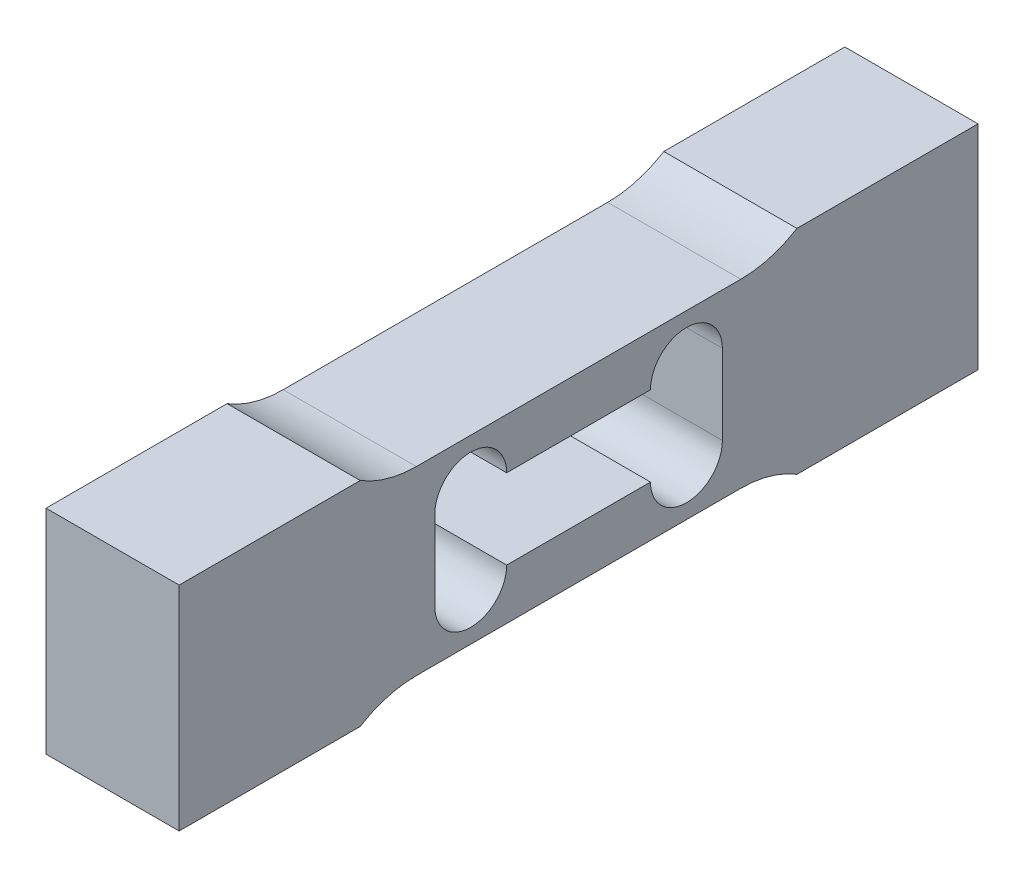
ISO-10303-21;
HEADER;
FILE_DESCRIPTION(('STEP AP214'),'2;1');
FILE_NAME('part.step','',(''),(''),'','','');
FILE_SCHEMA(('AUTOMOTIVE_DESIGN { 1 0 10303 214 1 1 1 1 }'));
ENDSEC;
DATA;
#1=APPLICATION_CONTEXT('core data for automotive mechanical design processes');
#2=APPLICATION_PROTOCOL_DEFINITION('international standard','automotive_design',2000,#1);
#3=PRODUCT_CONTEXT('',#1,'mechanical');
#4=PRODUCT('Part','Part','',(#3));
#5=PRODUCT_RELATED_PRODUCT_CATEGORY('part','',(#4));
#6=PRODUCT_DEFINITION_FORMATION('','',#4);
#7=PRODUCT_DEFINITION_CONTEXT('part definition',#1,'design');
#8=PRODUCT_DEFINITION('design','',#6,#7);
#9=PRODUCT_DEFINITION_SHAPE('','',#8);
#10=(LENGTH_UNIT() NAMED_UNIT(*) SI_UNIT(.MILLI.,.METRE.));
#11=(NAMED_UNIT(*) PLANE_ANGLE_UNIT() SI_UNIT($,.RADIAN.));
#12=(NAMED_UNIT(*) SI_UNIT($,.STERADIAN.) SOLID_ANGLE_UNIT());
#13=UNCERTAINTY_MEASURE_WITH_UNIT(LENGTH_MEASURE(1.E-05),#10,'distance_accuracy_value','');
#14=(GEOMETRIC_REPRESENTATION_CONTEXT(3) GLOBAL_UNCERTAINTY_ASSIGNED_CONTEXT((#13)) GLOBAL_UNIT_ASSIGNED_CONTEXT((#10,
#11,#12)) REPRESENTATION_CONTEXT('',''));
#15=CARTESIAN_POINT('',(0.,0.,0.));
#16=DIRECTION('',(0.,0.,1.));
#17=DIRECTION('',(1.,0.,0.));
#18=AXIS2_PLACEMENT_3D('',#15,#16,#17);
#19=CARTESIAN_POINT('',(12.5,-20.,75.));
#20=DIRECTION('',(0.,1.,0.));
#21=DIRECTION('',(0.,0.,1.));
#22=AXIS2_PLACEMENT_3D('',#19,#20,#21);
#23=PLANE('',#22);
#24=DIRECTION('',(0.,0.,-1.));
#25=VECTOR('',#24,1.);
#26=CARTESIAN_POINT('',(-12.5,-20.,75.));
#27=LINE('',#26,#25);
#28=CARTESIAN_POINT('',(-12.5,-20.,75.));
#29=VERTEX_POINT('',#28);
#30=CARTESIAN_POINT('',(-12.5,-20.,41.));
#31=VERTEX_POINT('',#30);
#32=EDGE_CURVE('E188',#29,#31,#27,.T.);
#33=ORIENTED_EDGE('',*,*,#32,.T.);
#34=DIRECTION('',(1.,0.,0.));
#35=VECTOR('',#34,1.);
#36=CARTESIAN_POINT('',(12.5,-20.,41.));
#37=LINE('',#36,#35);
#38=CARTESIAN_POINT('',(12.5,-20.,41.));
#39=VERTEX_POINT('',#38);
#40=EDGE_CURVE('E175',#31,#39,#37,.T.);
#41=ORIENTED_EDGE('',*,*,#40,.T.);
#42=DIRECTION('',(0.,0.,-1.));
#43=VECTOR('',#42,1.);
#44=CARTESIAN_POINT('',(12.5,-20.,75.));
#45=LINE('',#44,#43);
#46=CARTESIAN_POINT('',(12.5,-20.,75.));
#47=VERTEX_POINT('',#46);
#48=EDGE_CURVE('E186',#47,#39,#45,.T.);
#49=ORIENTED_EDGE('',*,*,#48,.F.);
#50=DIRECTION('',(-1.,0.,0.));
#51=VECTOR('',#50,1.);
#52=CARTESIAN_POINT('',(12.5,-20.,75.));
#53=LINE('',#52,#51);
#54=EDGE_CURVE('E229',#47,#29,#53,.T.);
#55=ORIENTED_EDGE('',*,*,#54,.T.);
#56=EDGE_LOOP('',(#33,#41,#49,#55));
#57=FACE_BOUND('',#56,.T.);
#58=ADVANCED_FACE('F34',(#57),#23,.F.);
#59=CARTESIAN_POINT('',(12.5,20.,75.));
#60=DIRECTION('',(0.,-1.,0.));
#61=DIRECTION('',(0.,0.,-1.));
#62=AXIS2_PLACEMENT_3D('',#59,#60,#61);
#63=PLANE('',#62);
#64=DIRECTION('',(0.,0.,1.));
#65=VECTOR('',#64,1.);
#66=CARTESIAN_POINT('',(12.5,20.,75.));
#67=LINE('',#66,#65);
#68=CARTESIAN_POINT('',(12.5,20.,41.));
#69=VERTEX_POINT('',#68);
#70=CARTESIAN_POINT('',(12.5,20.,75.));
#71=VERTEX_POINT('',#70);
#72=EDGE_CURVE('E200',#69,#71,#67,.T.);
#73=ORIENTED_EDGE('',*,*,#72,.F.);
#74=DIRECTION('',(-1.,0.,0.));
#75=VECTOR('',#74,1.);
#76=CARTESIAN_POINT('',(12.5,20.,41.));
#77=LINE('',#76,#75);
#78=CARTESIAN_POINT('',(-12.5,20.,41.));
#79=VERTEX_POINT('',#78);
#80=EDGE_CURVE('E234',#69,#79,#77,.T.);
#81=ORIENTED_EDGE('',*,*,#80,.T.);
#82=DIRECTION('',(0.,0.,1.));
#83=VECTOR('',#82,1.);
#84=CARTESIAN_POINT('',(-12.5,20.,75.));
#85=LINE('',#84,#83);
#86=CARTESIAN_POINT('',(-12.5,20.,75.));
#87=VERTEX_POINT('',#86);
#88=EDGE_CURVE('E217',#79,#87,#85,.T.);
#89=ORIENTED_EDGE('',*,*,#88,.T.);
#90=DIRECTION('',(-1.,0.,0.));
#91=VECTOR('',#90,1.);
#92=CARTESIAN_POINT('',(12.5,20.,75.));
#93=LINE('',#92,#91);
#94=EDGE_CURVE('E208',#71,#87,#93,.T.);
#95=ORIENTED_EDGE('',*,*,#94,.F.);
#96=EDGE_LOOP('',(#73,#81,#89,#95));
#97=FACE_BOUND('',#96,.T.);
#98=ADVANCED_FACE('F260',(#97),#63,.F.);
#99=CARTESIAN_POINT('',(12.5,-20.,75.));
#100=DIRECTION('',(1.,0.,0.));
#101=DIRECTION('',(0.,0.,-1.));
#102=AXIS2_PLACEMENT_3D('',#99,#100,#101);
#103=PLANE('',#102);
#104=ORIENTED_EDGE('',*,*,#48,.T.);
#105=CARTESIAN_POINT('',(12.5,-37.,30.4643462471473));
#106=DIRECTION('',(1.,0.,0.));
#107=DIRECTION('',(0.,0.,-1.));
#108=AXIS2_PLACEMENT_3D('',#105,#106,#107);
#109=CIRCLE('',#108,20.);
#110=CARTESIAN_POINT('',(12.5,-17.,30.4643462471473));
#111=VERTEX_POINT('',#110);
#112=EDGE_CURVE('E171',#39,#111,#109,.F.);
#113=ORIENTED_EDGE('',*,*,#112,.T.);
#114=DIRECTION('',(0.,0.,1.));
#115=VECTOR('',#114,1.);
#116=CARTESIAN_POINT('',(12.5,-17.,41.));
#117=LINE('',#116,#115);
#118=CARTESIAN_POINT('',(12.5,-17.,-30.4643462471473));
#119=VERTEX_POINT('',#118);
#120=EDGE_CURVE('E272',#119,#111,#117,.T.);
#121=ORIENTED_EDGE('',*,*,#120,.F.);
#122=CARTESIAN_POINT('',(12.5,-37.,-30.4643462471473));
#123=DIRECTION('',(1.,0.,0.));
#124=DIRECTION('',(0.,0.,-1.));
#125=AXIS2_PLACEMENT_3D('',#122,#123,#124);
#126=CIRCLE('',#125,20.);
#127=CARTESIAN_POINT('',(12.5,-20.,-41.));
#128=VERTEX_POINT('',#127);
#129=EDGE_CURVE('E245',#119,#128,#126,.F.);
#130=ORIENTED_EDGE('',*,*,#129,.T.);
#131=CARTESIAN_POINT('',(12.5,-20.,-75.));
#132=VERTEX_POINT('',#131);
#133=EDGE_CURVE('E198',#128,#132,#45,.T.);
#134=ORIENTED_EDGE('',*,*,#133,.T.);
#135=DIRECTION('',(0.,1.,0.));
#136=VECTOR('',#135,1.);
#137=CARTESIAN_POINT('',(12.5,20.,-75.));
#138=LINE('',#137,#136);
#139=CARTESIAN_POINT('',(12.5,20.,-75.));
#140=VERTEX_POINT('',#139);
#141=EDGE_CURVE('E197',#132,#140,#138,.T.);
#142=ORIENTED_EDGE('',*,*,#141,.T.);
#143=CARTESIAN_POINT('',(12.5,20.,-41.));
#144=VERTEX_POINT('',#143);
#145=EDGE_CURVE('E205',#140,#144,#67,.T.);
#146=ORIENTED_EDGE('',*,*,#145,.T.);
#147=CARTESIAN_POINT('',(12.5,37.,-30.4643462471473));
#148=DIRECTION('',(1.,0.,0.));
#149=DIRECTION('',(0.,0.,-1.));
#150=AXIS2_PLACEMENT_3D('',#147,#148,#149);
#151=CIRCLE('',#150,20.);
#152=CARTESIAN_POINT('',(12.5,17.,-30.4643462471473));
#153=VERTEX_POINT('',#152);
#154=EDGE_CURVE('E249',#144,#153,#151,.F.);
#155=ORIENTED_EDGE('',*,*,#154,.T.);
#156=DIRECTION('',(0.,0.,-1.));
#157=VECTOR('',#156,1.);
#158=CARTESIAN_POINT('',(12.5,17.,41.));
#159=LINE('',#158,#157);
#160=CARTESIAN_POINT('',(12.5,17.,30.4643462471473));
#161=VERTEX_POINT('',#160);
#162=EDGE_CURVE('E255',#161,#153,#159,.T.);
#163=ORIENTED_EDGE('',*,*,#162,.F.);
#164=CARTESIAN_POINT('',(12.5,37.,30.4643462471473));
#165=DIRECTION('',(1.,0.,0.));
#166=DIRECTION('',(0.,0.,-1.));
#167=AXIS2_PLACEMENT_3D('',#164,#165,#166);
#168=CIRCLE('',#167,20.);
#169=EDGE_CURVE('E42',#161,#69,#168,.F.);
#170=ORIENTED_EDGE('',*,*,#169,.T.);
#171=ORIENTED_EDGE('',*,*,#72,.T.);
#172=DIRECTION('',(0.,-1.,0.));
#173=VECTOR('',#172,1.);
#174=CARTESIAN_POINT('',(12.5,20.,75.));
#175=LINE('',#174,#173);
#176=EDGE_CURVE('E195',#71,#47,#175,.T.);
#177=ORIENTED_EDGE('',*,*,#176,.T.);
#178=EDGE_LOOP('',(#104,#113,#121,#130,#134,#142,#146,#155,#163,#170,#171,#177));
#179=FACE_BOUND('',#178,.T.);
#180=DIRECTION('',(0.,-1.,0.));
#181=VECTOR('',#180,1.);
#182=CARTESIAN_POINT('',(12.5,7.49999999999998,27.));
#183=LINE('',#182,#181);
#184=CARTESIAN_POINT('',(12.5,7.49999999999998,27.));
#185=VERTEX_POINT('',#184);
#186=CARTESIAN_POINT('',(12.5,-7.50000000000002,27.));
#187=VERTEX_POINT('',#186);
#188=EDGE_CURVE('E277',#185,#187,#183,.T.);
#189=ORIENTED_EDGE('',*,*,#188,.F.);
#190=CARTESIAN_POINT('',(12.5,7.49999999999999,20.25));
#191=DIRECTION('',(1.,0.,0.));
#192=DIRECTION('',(0.,0.,1.));
#193=AXIS2_PLACEMENT_3D('',#190,#191,#192);
#194=CIRCLE('',#193,6.75);
#195=CARTESIAN_POINT('',(12.5,7.5,13.5));
#196=VERTEX_POINT('',#195);
#197=EDGE_CURVE('E275',#196,#185,#194,.T.);
#198=ORIENTED_EDGE('',*,*,#197,.F.);
#199=DIRECTION('',(0.,0.,1.));
#200=VECTOR('',#199,1.);
#201=CARTESIAN_POINT('',(12.5,7.5,13.5));
#202=LINE('',#201,#200);
#203=CARTESIAN_POINT('',(12.5,7.50000000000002,-13.5));
#204=VERTEX_POINT('',#203);
#205=EDGE_CURVE('E291',#204,#196,#202,.T.);
#206=ORIENTED_EDGE('',*,*,#205,.F.);
#207=CARTESIAN_POINT('',(12.5,7.50000000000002,-20.25));
#208=DIRECTION('',(1.,0.,0.));
#209=DIRECTION('',(0.,0.,1.));
#210=AXIS2_PLACEMENT_3D('',#207,#208,#209);
#211=CIRCLE('',#210,6.75);
#212=CARTESIAN_POINT('',(12.5,7.50000000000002,-27.));
#213=VERTEX_POINT('',#212);
#214=EDGE_CURVE('E288',#213,#204,#211,.T.);
#215=ORIENTED_EDGE('',*,*,#214,.F.);
#216=DIRECTION('',(0.,1.,0.));
#217=VECTOR('',#216,1.);
#218=CARTESIAN_POINT('',(12.5,7.50000000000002,-27.));
#219=LINE('',#218,#217);
#220=CARTESIAN_POINT('',(12.5,-7.49999999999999,-27.));
#221=VERTEX_POINT('',#220);
#222=EDGE_CURVE('E286',#221,#213,#219,.T.);
#223=ORIENTED_EDGE('',*,*,#222,.F.);
#224=CARTESIAN_POINT('',(12.5,-7.5,-20.25));
#225=DIRECTION('',(1.,0.,0.));
#226=DIRECTION('',(0.,0.,1.));
#227=AXIS2_PLACEMENT_3D('',#224,#225,#226);
#228=CIRCLE('',#227,6.75);
#229=CARTESIAN_POINT('',(12.5,-7.5,-13.5));
#230=VERTEX_POINT('',#229);
#231=EDGE_CURVE('E284',#230,#221,#228,.T.);
#232=ORIENTED_EDGE('',*,*,#231,.F.);
#233=DIRECTION('',(0.,0.,-1.));
#234=VECTOR('',#233,1.);
#235=CARTESIAN_POINT('',(12.5,-7.5,13.5));
#236=LINE('',#235,#234);
#237=CARTESIAN_POINT('',(12.5,-7.5,13.5));
#238=VERTEX_POINT('',#237);
#239=EDGE_CURVE('E282',#238,#230,#236,.T.);
#240=ORIENTED_EDGE('',*,*,#239,.F.);
#241=CARTESIAN_POINT('',(12.5,-7.50000000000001,20.25));
#242=DIRECTION('',(1.,0.,0.));
#243=DIRECTION('',(0.,0.,-1.));
#244=AXIS2_PLACEMENT_3D('',#241,#242,#243);
#245=CIRCLE('',#244,6.75);
#246=EDGE_CURVE('E280',#187,#238,#245,.T.);
#247=ORIENTED_EDGE('',*,*,#246,.F.);
#248=EDGE_LOOP('',(#189,#198,#206,#215,#223,#232,#240,#247));
#249=FACE_BOUND('',#248,.T.);
#250=ADVANCED_FACE('F192',(#179,#249),#103,.T.);
#251=CARTESIAN_POINT('',(-12.5,-20.,75.));
#252=DIRECTION('',(1.,0.,0.));
#253=DIRECTION('',(0.,0.,-1.));
#254=AXIS2_PLACEMENT_3D('',#251,#252,#253);
#255=PLANE('',#254);
#256=CARTESIAN_POINT('',(-12.5,-20.,-41.));
#257=VERTEX_POINT('',#256);
#258=CARTESIAN_POINT('',(-12.5,-20.,-75.));
#259=VERTEX_POINT('',#258);
#260=EDGE_CURVE('E212',#257,#259,#27,.T.);
#261=ORIENTED_EDGE('',*,*,#260,.F.);
#262=CARTESIAN_POINT('',(-12.5,-37.,-30.4643462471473));
#263=DIRECTION('',(1.,0.,0.));
#264=DIRECTION('',(0.,0.,-1.));
#265=AXIS2_PLACEMENT_3D('',#262,#263,#264);
#266=CIRCLE('',#265,20.);
#267=CARTESIAN_POINT('',(-12.5,-17.,-30.4643462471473));
#268=VERTEX_POINT('',#267);
#269=EDGE_CURVE('E247',#257,#268,#266,.T.);
#270=ORIENTED_EDGE('',*,*,#269,.T.);
#271=DIRECTION('',(0.,0.,1.));
#272=VECTOR('',#271,1.);
#273=CARTESIAN_POINT('',(-12.5,-17.,41.));
#274=LINE('',#273,#272);
#275=CARTESIAN_POINT('',(-12.5,-17.,30.4643462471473));
#276=VERTEX_POINT('',#275);
#277=EDGE_CURVE('E269',#268,#276,#274,.T.);
#278=ORIENTED_EDGE('',*,*,#277,.T.);
#279=CARTESIAN_POINT('',(-12.5,-37.,30.4643462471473));
#280=DIRECTION('',(1.,0.,0.));
#281=DIRECTION('',(0.,0.,-1.));
#282=AXIS2_PLACEMENT_3D('',#279,#280,#281);
#283=CIRCLE('',#282,20.);
#284=EDGE_CURVE('E181',#276,#31,#283,.T.);
#285=ORIENTED_EDGE('',*,*,#284,.T.);
#286=ORIENTED_EDGE('',*,*,#32,.F.);
#287=DIRECTION('',(0.,-1.,0.));
#288=VECTOR('',#287,1.);
#289=CARTESIAN_POINT('',(-12.5,20.,75.));
#290=LINE('',#289,#288);
#291=EDGE_CURVE('E209',#87,#29,#290,.T.);
#292=ORIENTED_EDGE('',*,*,#291,.F.);
#293=ORIENTED_EDGE('',*,*,#88,.F.);
#294=CARTESIAN_POINT('',(-12.5,37.,30.4643462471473));
#295=DIRECTION('',(1.,0.,0.));
#296=DIRECTION('',(0.,0.,-1.));
#297=AXIS2_PLACEMENT_3D('',#294,#295,#296);
#298=CIRCLE('',#297,20.);
#299=CARTESIAN_POINT('',(-12.5,17.,30.4643462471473));
#300=VERTEX_POINT('',#299);
#301=EDGE_CURVE('E11',#79,#300,#298,.T.);
#302=ORIENTED_EDGE('',*,*,#301,.T.);
#303=DIRECTION('',(0.,0.,-1.));
#304=VECTOR('',#303,1.);
#305=CARTESIAN_POINT('',(-12.5,17.,41.));
#306=LINE('',#305,#304);
#307=CARTESIAN_POINT('',(-12.5,17.,-30.4643462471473));
#308=VERTEX_POINT('',#307);
#309=EDGE_CURVE('E262',#300,#308,#306,.T.);
#310=ORIENTED_EDGE('',*,*,#309,.T.);
#311=CARTESIAN_POINT('',(-12.5,37.,-30.4643462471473));
#312=DIRECTION('',(1.,0.,0.));
#313=DIRECTION('',(0.,0.,-1.));
#314=AXIS2_PLACEMENT_3D('',#311,#312,#313);
#315=CIRCLE('',#314,20.);
#316=CARTESIAN_POINT('',(-12.5,20.,-41.));
#317=VERTEX_POINT('',#316);
#318=EDGE_CURVE('E251',#308,#317,#315,.T.);
#319=ORIENTED_EDGE('',*,*,#318,.T.);
#320=CARTESIAN_POINT('',(-12.5,20.,-75.));
#321=VERTEX_POINT('',#320);
#322=EDGE_CURVE('E218',#321,#317,#85,.T.);
#323=ORIENTED_EDGE('',*,*,#322,.F.);
#324=DIRECTION('',(0.,1.,0.));
#325=VECTOR('',#324,1.);
#326=CARTESIAN_POINT('',(-12.5,20.,-75.));
#327=LINE('',#326,#325);
#328=EDGE_CURVE('E215',#259,#321,#327,.T.);
#329=ORIENTED_EDGE('',*,*,#328,.F.);
#330=EDGE_LOOP('',(#261,#270,#278,#285,#286,#292,#293,#302,#310,#319,#323,#329));
#331=FACE_BOUND('',#330,.T.);
#332=CARTESIAN_POINT('',(-12.5,7.49999999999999,20.25));
#333=DIRECTION('',(1.,0.,0.));
#334=DIRECTION('',(0.,0.,1.));
#335=AXIS2_PLACEMENT_3D('',#332,#333,#334);
#336=CIRCLE('',#335,6.75);
#337=CARTESIAN_POINT('',(-12.5,7.5,13.5));
#338=VERTEX_POINT('',#337);
#339=CARTESIAN_POINT('',(-12.5,7.49999999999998,27.));
#340=VERTEX_POINT('',#339);
#341=EDGE_CURVE('E264',#338,#340,#336,.T.);
#342=ORIENTED_EDGE('',*,*,#341,.T.);
#343=DIRECTION('',(0.,-1.,0.));
#344=VECTOR('',#343,1.);
#345=CARTESIAN_POINT('',(-12.5,7.49999999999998,27.));
#346=LINE('',#345,#344);
#347=CARTESIAN_POINT('',(-12.5,-7.50000000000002,27.));
#348=VERTEX_POINT('',#347);
#349=EDGE_CURVE('E267',#340,#348,#346,.T.);
#350=ORIENTED_EDGE('',*,*,#349,.T.);
#351=CARTESIAN_POINT('',(-12.5,-7.50000000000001,20.25));
#352=DIRECTION('',(1.,0.,0.));
#353=DIRECTION('',(0.,0.,-1.));
#354=AXIS2_PLACEMENT_3D('',#351,#352,#353);
#355=CIRCLE('',#354,6.75);
#356=CARTESIAN_POINT('',(-12.5,-7.5,13.5));
#357=VERTEX_POINT('',#356);
#358=EDGE_CURVE('E296',#348,#357,#355,.T.);
#359=ORIENTED_EDGE('',*,*,#358,.T.);
#360=DIRECTION('',(0.,0.,-1.));
#361=VECTOR('',#360,1.);
#362=CARTESIAN_POINT('',(-12.5,-7.5,13.5));
#363=LINE('',#362,#361);
#364=CARTESIAN_POINT('',(-12.5,-7.5,-13.5));
#365=VERTEX_POINT('',#364);
#366=EDGE_CURVE('E299',#357,#365,#363,.T.);
#367=ORIENTED_EDGE('',*,*,#366,.T.);
#368=CARTESIAN_POINT('',(-12.5,-7.5,-20.25));
#369=DIRECTION('',(1.,0.,0.));
#370=DIRECTION('',(0.,0.,1.));
#371=AXIS2_PLACEMENT_3D('',#368,#369,#370);
#372=CIRCLE('',#371,6.75);
#373=CARTESIAN_POINT('',(-12.5,-7.49999999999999,-27.));
#374=VERTEX_POINT('',#373);
#375=EDGE_CURVE('E302',#365,#374,#372,.T.);
#376=ORIENTED_EDGE('',*,*,#375,.T.);
#377=DIRECTION('',(0.,1.,0.));
#378=VECTOR('',#377,1.);
#379=CARTESIAN_POINT('',(-12.5,7.50000000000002,-27.));
#380=LINE('',#379,#378);
#381=CARTESIAN_POINT('',(-12.5,7.50000000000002,-27.));
#382=VERTEX_POINT('',#381);
#383=EDGE_CURVE('E305',#374,#382,#380,.T.);
#384=ORIENTED_EDGE('',*,*,#383,.T.);
#385=CARTESIAN_POINT('',(-12.5,7.50000000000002,-20.25));
#386=DIRECTION('',(1.,0.,0.));
#387=DIRECTION('',(0.,0.,1.));
#388=AXIS2_PLACEMENT_3D('',#385,#386,#387);
#389=CIRCLE('',#388,6.75);
#390=CARTESIAN_POINT('',(-12.5,7.50000000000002,-13.5));
#391=VERTEX_POINT('',#390);
#392=EDGE_CURVE('E308',#382,#391,#389,.T.);
#393=ORIENTED_EDGE('',*,*,#392,.T.);
#394=DIRECTION('',(0.,0.,1.));
#395=VECTOR('',#394,1.);
#396=CARTESIAN_POINT('',(-12.5,7.5,13.5));
#397=LINE('',#396,#395);
#398=EDGE_CURVE('E278',#391,#338,#397,.T.);
#399=ORIENTED_EDGE('',*,*,#398,.T.);
#400=EDGE_LOOP('',(#342,#350,#359,#367,#376,#384,#393,#399));
#401=FACE_BOUND('',#400,.T.);
#402=ADVANCED_FACE('F335',(#331,#401),#255,.F.);
#403=CARTESIAN_POINT('',(12.5,20.,75.));
#404=DIRECTION('',(0.,0.,-1.));
#405=DIRECTION('',(-1.,0.,0.));
#406=AXIS2_PLACEMENT_3D('',#403,#404,#405);
#407=PLANE('',#406);
#408=ORIENTED_EDGE('',*,*,#291,.T.);
#409=ORIENTED_EDGE('',*,*,#54,.F.);
#410=ORIENTED_EDGE('',*,*,#176,.F.);
#411=ORIENTED_EDGE('',*,*,#94,.T.);
#412=EDGE_LOOP('',(#408,#409,#410,#411));
#413=FACE_BOUND('',#412,.T.);
#414=ADVANCED_FACE('F386',(#413),#407,.F.);
#415=ORIENTED_EDGE('',*,*,#133,.F.);
#416=DIRECTION('',(-1.,0.,0.));
#417=VECTOR('',#416,1.);
#418=CARTESIAN_POINT('',(12.5,-20.,-41.));
#419=LINE('',#418,#417);
#420=EDGE_CURVE('E190',#128,#257,#419,.T.);
#421=ORIENTED_EDGE('',*,*,#420,.T.);
#422=ORIENTED_EDGE('',*,*,#260,.T.);
#423=DIRECTION('',(-1.,0.,0.));
#424=VECTOR('',#423,1.);
#425=CARTESIAN_POINT('',(12.5,-20.,-75.));
#426=LINE('',#425,#424);
#427=EDGE_CURVE('E226',#132,#259,#426,.T.);
#428=ORIENTED_EDGE('',*,*,#427,.F.);
#429=EDGE_LOOP('',(#415,#421,#422,#428));
#430=FACE_BOUND('',#429,.T.);
#431=ADVANCED_FACE('F376',(#430),#23,.F.);
#432=CARTESIAN_POINT('',(12.5,20.,-75.));
#433=DIRECTION('',(0.,0.,1.));
#434=DIRECTION('',(1.,0.,0.));
#435=AXIS2_PLACEMENT_3D('',#432,#433,#434);
#436=PLANE('',#435);
#437=ORIENTED_EDGE('',*,*,#328,.T.);
#438=DIRECTION('',(-1.,0.,0.));
#439=VECTOR('',#438,1.);
#440=CARTESIAN_POINT('',(12.5,20.,-75.));
#441=LINE('',#440,#439);
#442=EDGE_CURVE('E223',#140,#321,#441,.T.);
#443=ORIENTED_EDGE('',*,*,#442,.F.);
#444=ORIENTED_EDGE('',*,*,#141,.F.);
#445=ORIENTED_EDGE('',*,*,#427,.T.);
#446=EDGE_LOOP('',(#437,#443,#444,#445));
#447=FACE_BOUND('',#446,.T.);
#448=ADVANCED_FACE('F385',(#447),#436,.F.);
#449=ORIENTED_EDGE('',*,*,#322,.T.);
#450=DIRECTION('',(1.,0.,0.));
#451=VECTOR('',#450,1.);
#452=CARTESIAN_POINT('',(12.5,20.,-41.));
#453=LINE('',#452,#451);
#454=EDGE_CURVE('E231',#317,#144,#453,.T.);
#455=ORIENTED_EDGE('',*,*,#454,.T.);
#456=ORIENTED_EDGE('',*,*,#145,.F.);
#457=ORIENTED_EDGE('',*,*,#442,.T.);
#458=EDGE_LOOP('',(#449,#455,#456,#457));
#459=FACE_BOUND('',#458,.T.);
#460=ADVANCED_FACE('F381',(#459),#63,.F.);
#461=CARTESIAN_POINT('',(12.5,7.49999999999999,20.25));
#462=DIRECTION('',(-1.,0.,0.));
#463=DIRECTION('',(0.,0.,1.));
#464=AXIS2_PLACEMENT_3D('',#461,#462,#463);
#465=CYLINDRICAL_SURFACE('',#464,6.75);
#466=ORIENTED_EDGE('',*,*,#341,.F.);
#467=DIRECTION('',(-1.,0.,0.));
#468=VECTOR('',#467,1.);
#469=CARTESIAN_POINT('',(12.5,7.5,13.5));
#470=LINE('',#469,#468);
#471=EDGE_CURVE('E292',#196,#338,#470,.T.);
#472=ORIENTED_EDGE('',*,*,#471,.F.);
#473=ORIENTED_EDGE('',*,*,#197,.T.);
#474=DIRECTION('',(-1.,0.,0.));
#475=VECTOR('',#474,1.);
#476=CARTESIAN_POINT('',(12.5,7.49999999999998,27.));
#477=LINE('',#476,#475);
#478=EDGE_CURVE('E213',#185,#340,#477,.T.);
#479=ORIENTED_EDGE('',*,*,#478,.T.);
#480=EDGE_LOOP('',(#466,#472,#473,#479));
#481=FACE_BOUND('',#480,.T.);
#482=ADVANCED_FACE('F329',(#481),#465,.F.);
#483=CARTESIAN_POINT('',(12.5,7.49999999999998,27.));
#484=DIRECTION('',(0.,0.,-1.));
#485=DIRECTION('',(-1.,0.,0.));
#486=AXIS2_PLACEMENT_3D('',#483,#484,#485);
#487=PLANE('',#486);
#488=ORIENTED_EDGE('',*,*,#349,.F.);
#489=ORIENTED_EDGE('',*,*,#478,.F.);
#490=ORIENTED_EDGE('',*,*,#188,.T.);
#491=DIRECTION('',(-1.,0.,0.));
#492=VECTOR('',#491,1.);
#493=CARTESIAN_POINT('',(12.5,-7.50000000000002,27.));
#494=LINE('',#493,#492);
#495=EDGE_CURVE('E325',#187,#348,#494,.T.);
#496=ORIENTED_EDGE('',*,*,#495,.T.);
#497=EDGE_LOOP('',(#488,#489,#490,#496));
#498=FACE_BOUND('',#497,.T.);
#499=ADVANCED_FACE('F345',(#498),#487,.T.);
#500=CARTESIAN_POINT('',(12.5,-7.50000000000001,20.25));
#501=DIRECTION('',(-1.,0.,0.));
#502=DIRECTION('',(0.,0.,1.));
#503=AXIS2_PLACEMENT_3D('',#500,#501,#502);
#504=CYLINDRICAL_SURFACE('',#503,6.75);
#505=ORIENTED_EDGE('',*,*,#358,.F.);
#506=ORIENTED_EDGE('',*,*,#495,.F.);
#507=ORIENTED_EDGE('',*,*,#246,.T.);
#508=DIRECTION('',(-1.,0.,0.));
#509=VECTOR('',#508,1.);
#510=CARTESIAN_POINT('',(12.5,-7.5,13.5));
#511=LINE('',#510,#509);
#512=EDGE_CURVE('E323',#238,#357,#511,.T.);
#513=ORIENTED_EDGE('',*,*,#512,.T.);
#514=EDGE_LOOP('',(#505,#506,#507,#513));
#515=FACE_BOUND('',#514,.T.);
#516=ADVANCED_FACE('F348',(#515),#504,.F.);
#517=CARTESIAN_POINT('',(12.5,-7.5,13.5));
#518=DIRECTION('',(0.,1.,0.));
#519=DIRECTION('',(0.,0.,1.));
#520=AXIS2_PLACEMENT_3D('',#517,#518,#519);
#521=PLANE('',#520);
#522=ORIENTED_EDGE('',*,*,#366,.F.);
#523=ORIENTED_EDGE('',*,*,#512,.F.);
#524=ORIENTED_EDGE('',*,*,#239,.T.);
#525=DIRECTION('',(-1.,0.,0.));
#526=VECTOR('',#525,1.);
#527=CARTESIAN_POINT('',(12.5,-7.5,-13.5));
#528=LINE('',#527,#526);
#529=EDGE_CURVE('E321',#230,#365,#528,.T.);
#530=ORIENTED_EDGE('',*,*,#529,.T.);
#531=EDGE_LOOP('',(#522,#523,#524,#530));
#532=FACE_BOUND('',#531,.T.);
#533=ADVANCED_FACE('F353',(#532),#521,.T.);
#534=CARTESIAN_POINT('',(12.5,-7.5,-20.25));
#535=DIRECTION('',(-1.,0.,0.));
#536=DIRECTION('',(0.,0.,1.));
#537=AXIS2_PLACEMENT_3D('',#534,#535,#536);
#538=CYLINDRICAL_SURFACE('',#537,6.75);
#539=ORIENTED_EDGE('',*,*,#375,.F.);
#540=ORIENTED_EDGE('',*,*,#529,.F.);
#541=ORIENTED_EDGE('',*,*,#231,.T.);
#542=DIRECTION('',(-1.,0.,0.));
#543=VECTOR('',#542,1.);
#544=CARTESIAN_POINT('',(12.5,-7.49999999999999,-27.));
#545=LINE('',#544,#543);
#546=EDGE_CURVE('E319',#221,#374,#545,.T.);
#547=ORIENTED_EDGE('',*,*,#546,.T.);
#548=EDGE_LOOP('',(#539,#540,#541,#547));
#549=FACE_BOUND('',#548,.T.);
#550=ADVANCED_FACE('F357',(#549),#538,.F.);
#551=CARTESIAN_POINT('',(12.5,7.50000000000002,-27.));
#552=DIRECTION('',(0.,0.,1.));
#553=DIRECTION('',(0.,-1.,0.));
#554=AXIS2_PLACEMENT_3D('',#551,#552,#553);
#555=PLANE('',#554);
#556=ORIENTED_EDGE('',*,*,#383,.F.);
#557=ORIENTED_EDGE('',*,*,#546,.F.);
#558=ORIENTED_EDGE('',*,*,#222,.T.);
#559=DIRECTION('',(-1.,0.,0.));
#560=VECTOR('',#559,1.);
#561=CARTESIAN_POINT('',(12.5,7.50000000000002,-27.));
#562=LINE('',#561,#560);
#563=EDGE_CURVE('E317',#213,#382,#562,.T.);
#564=ORIENTED_EDGE('',*,*,#563,.T.);
#565=EDGE_LOOP('',(#556,#557,#558,#564));
#566=FACE_BOUND('',#565,.T.);
#567=ADVANCED_FACE('F362',(#566),#555,.T.);
#568=CARTESIAN_POINT('',(12.5,7.50000000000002,-20.25));
#569=DIRECTION('',(-1.,0.,0.));
#570=DIRECTION('',(0.,0.,1.));
#571=AXIS2_PLACEMENT_3D('',#568,#569,#570);
#572=CYLINDRICAL_SURFACE('',#571,6.75);
#573=ORIENTED_EDGE('',*,*,#392,.F.);
#574=ORIENTED_EDGE('',*,*,#563,.F.);
#575=ORIENTED_EDGE('',*,*,#214,.T.);
#576=DIRECTION('',(-1.,0.,0.));
#577=VECTOR('',#576,1.);
#578=CARTESIAN_POINT('',(12.5,7.50000000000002,-13.5));
#579=LINE('',#578,#577);
#580=EDGE_CURVE('E315',#204,#391,#579,.T.);
#581=ORIENTED_EDGE('',*,*,#580,.T.);
#582=EDGE_LOOP('',(#573,#574,#575,#581));
#583=FACE_BOUND('',#582,.T.);
#584=ADVANCED_FACE('F365',(#583),#572,.F.);
#585=CARTESIAN_POINT('',(12.5,7.5,13.5));
#586=DIRECTION('',(0.,-1.,0.));
#587=DIRECTION('',(0.,0.,-1.));
#588=AXIS2_PLACEMENT_3D('',#585,#586,#587);
#589=PLANE('',#588);
#590=ORIENTED_EDGE('',*,*,#398,.F.);
#591=ORIENTED_EDGE('',*,*,#580,.F.);
#592=ORIENTED_EDGE('',*,*,#205,.T.);
#593=ORIENTED_EDGE('',*,*,#471,.T.);
#594=EDGE_LOOP('',(#590,#591,#592,#593));
#595=FACE_BOUND('',#594,.T.);
#596=ADVANCED_FACE('F339',(#595),#589,.T.);
#597=CARTESIAN_POINT('',(-12.5,17.,41.));
#598=DIRECTION('',(0.,-1.,0.));
#599=DIRECTION('',(0.,0.,-1.));
#600=AXIS2_PLACEMENT_3D('',#597,#598,#599);
#601=PLANE('',#600);
#602=ORIENTED_EDGE('',*,*,#162,.T.);
#603=DIRECTION('',(-1.,0.,0.));
#604=VECTOR('',#603,1.);
#605=CARTESIAN_POINT('',(-12.5,17.,-30.4643462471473));
#606=LINE('',#605,#604);
#607=EDGE_CURVE('E49',#153,#308,#606,.T.);
#608=ORIENTED_EDGE('',*,*,#607,.T.);
#609=ORIENTED_EDGE('',*,*,#309,.F.);
#610=DIRECTION('',(1.,0.,0.));
#611=VECTOR('',#610,1.);
#612=CARTESIAN_POINT('',(-12.5,17.,30.4643462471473));
#613=LINE('',#612,#611);
#614=EDGE_CURVE('E240',#300,#161,#613,.T.);
#615=ORIENTED_EDGE('',*,*,#614,.T.);
#616=EDGE_LOOP('',(#602,#608,#609,#615));
#617=FACE_BOUND('',#616,.T.);
#618=ADVANCED_FACE('F261',(#617),#601,.F.);
#619=CARTESIAN_POINT('',(-12.5,-17.,41.));
#620=DIRECTION('',(0.,1.,0.));
#621=DIRECTION('',(0.,0.,1.));
#622=AXIS2_PLACEMENT_3D('',#619,#620,#621);
#623=PLANE('',#622);
#624=ORIENTED_EDGE('',*,*,#120,.T.);
#625=DIRECTION('',(-1.,0.,0.));
#626=VECTOR('',#625,1.);
#627=CARTESIAN_POINT('',(-12.5,-17.,30.4643462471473));
#628=LINE('',#627,#626);
#629=EDGE_CURVE('E176',#111,#276,#628,.T.);
#630=ORIENTED_EDGE('',*,*,#629,.T.);
#631=ORIENTED_EDGE('',*,*,#277,.F.);
#632=DIRECTION('',(1.,0.,0.));
#633=VECTOR('',#632,1.);
#634=CARTESIAN_POINT('',(-12.5,-17.,-30.4643462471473));
#635=LINE('',#634,#633);
#636=EDGE_CURVE('E189',#268,#119,#635,.T.);
#637=ORIENTED_EDGE('',*,*,#636,.T.);
#638=EDGE_LOOP('',(#624,#630,#631,#637));
#639=FACE_BOUND('',#638,.T.);
#640=ADVANCED_FACE('F407',(#639),#623,.F.);
#641=CARTESIAN_POINT('',(-12.5,-37.,30.4643462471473));
#642=DIRECTION('',(-1.,0.,0.));
#643=DIRECTION('',(0.,0.,1.));
#644=AXIS2_PLACEMENT_3D('',#641,#642,#643);
#645=CYLINDRICAL_SURFACE('',#644,20.);
#646=ORIENTED_EDGE('',*,*,#284,.F.);
#647=ORIENTED_EDGE('',*,*,#629,.F.);
#648=ORIENTED_EDGE('',*,*,#112,.F.);
#649=ORIENTED_EDGE('',*,*,#40,.F.);
#650=EDGE_LOOP('',(#646,#647,#648,#649));
#651=FACE_BOUND('',#650,.T.);
#652=ADVANCED_FACE('F174',(#651),#645,.F.);
#653=CARTESIAN_POINT('',(-12.5,-37.,-30.4643462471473));
#654=DIRECTION('',(1.,0.,0.));
#655=DIRECTION('',(0.,0.,-1.));
#656=AXIS2_PLACEMENT_3D('',#653,#654,#655);
#657=CYLINDRICAL_SURFACE('',#656,20.);
#658=ORIENTED_EDGE('',*,*,#269,.F.);
#659=ORIENTED_EDGE('',*,*,#420,.F.);
#660=ORIENTED_EDGE('',*,*,#129,.F.);
#661=ORIENTED_EDGE('',*,*,#636,.F.);
#662=EDGE_LOOP('',(#658,#659,#660,#661));
#663=FACE_BOUND('',#662,.T.);
#664=ADVANCED_FACE('F401',(#663),#657,.F.);
#665=CARTESIAN_POINT('',(-12.5,37.,-30.4643462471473));
#666=DIRECTION('',(-1.,0.,0.));
#667=DIRECTION('',(0.,0.,1.));
#668=AXIS2_PLACEMENT_3D('',#665,#666,#667);
#669=CYLINDRICAL_SURFACE('',#668,20.);
#670=ORIENTED_EDGE('',*,*,#318,.F.);
#671=ORIENTED_EDGE('',*,*,#607,.F.);
#672=ORIENTED_EDGE('',*,*,#154,.F.);
#673=ORIENTED_EDGE('',*,*,#454,.F.);
#674=EDGE_LOOP('',(#670,#671,#672,#673));
#675=FACE_BOUND('',#674,.T.);
#676=ADVANCED_FACE('F531',(#675),#669,.F.);
#677=CARTESIAN_POINT('',(-12.5,37.,30.4643462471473));
#678=DIRECTION('',(1.,0.,0.));
#679=DIRECTION('',(0.,0.,-1.));
#680=AXIS2_PLACEMENT_3D('',#677,#678,#679);
#681=CYLINDRICAL_SURFACE('',#680,20.);
#682=ORIENTED_EDGE('',*,*,#301,.F.);
#683=ORIENTED_EDGE('',*,*,#80,.F.);
#684=ORIENTED_EDGE('',*,*,#169,.F.);
#685=ORIENTED_EDGE('',*,*,#614,.F.);
#686=EDGE_LOOP('',(#682,#683,#684,#685));
#687=FACE_BOUND('',#686,.T.);
#688=ADVANCED_FACE('F36',(#687),#681,.F.);
#689=CLOSED_SHELL('',(#58,#98,#250,#402,#414,#431,#448,#460,#482,#499,#516,#533,#550,#567,#584,
#596,#618,#640,#652,#664,#676,#688));
#690=MANIFOLD_SOLID_BREP('B2',#689);
#691=ADVANCED_BREP_SHAPE_REPRESENTATION('',(#18,#690),#14);
#692=SHAPE_DEFINITION_REPRESENTATION(#9,#691);
ENDSEC;
END-ISO-10303-21;
